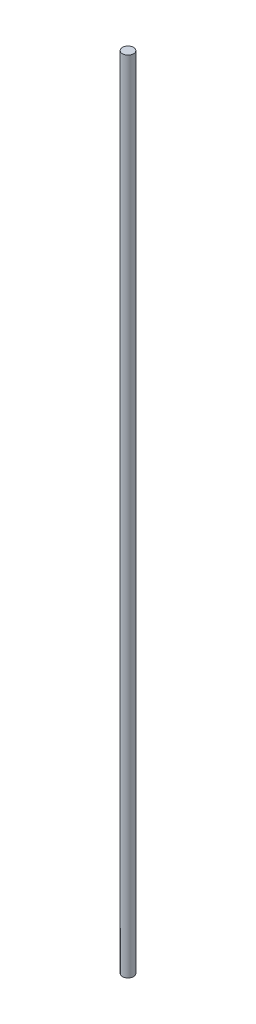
ISO-10303-21;
HEADER;
FILE_DESCRIPTION(('STEP AP214'),'2;1');
FILE_NAME('part.step','',(''),(''),'','','');
FILE_SCHEMA(('AUTOMOTIVE_DESIGN { 1 0 10303 214 1 1 1 1 }'));
ENDSEC;
DATA;
#1=APPLICATION_CONTEXT('core data for automotive mechanical design processes');
#2=APPLICATION_PROTOCOL_DEFINITION('international standard','automotive_design',2000,#1);
#3=PRODUCT_CONTEXT('',#1,'mechanical');
#4=PRODUCT('Part','Part','',(#3));
#5=PRODUCT_RELATED_PRODUCT_CATEGORY('part','',(#4));
#6=PRODUCT_DEFINITION_FORMATION('','',#4);
#7=PRODUCT_DEFINITION_CONTEXT('part definition',#1,'design');
#8=PRODUCT_DEFINITION('design','',#6,#7);
#9=PRODUCT_DEFINITION_SHAPE('','',#8);
#10=(LENGTH_UNIT() NAMED_UNIT(*) SI_UNIT(.MILLI.,.METRE.));
#11=(NAMED_UNIT(*) PLANE_ANGLE_UNIT() SI_UNIT($,.RADIAN.));
#12=(NAMED_UNIT(*) SI_UNIT($,.STERADIAN.) SOLID_ANGLE_UNIT());
#13=UNCERTAINTY_MEASURE_WITH_UNIT(LENGTH_MEASURE(1.E-05),#10,'distance_accuracy_value','');
#14=(GEOMETRIC_REPRESENTATION_CONTEXT(3) GLOBAL_UNCERTAINTY_ASSIGNED_CONTEXT((#13)) GLOBAL_UNIT_ASSIGNED_CONTEXT((#10,
#11,#12)) REPRESENTATION_CONTEXT('',''));
#15=CARTESIAN_POINT('',(0.,0.,0.));
#16=DIRECTION('',(0.,0.,1.));
#17=DIRECTION('',(1.,0.,0.));
#18=AXIS2_PLACEMENT_3D('',#15,#16,#17);
#19=CARTESIAN_POINT('',(0.,179.1,0.));
#20=DIRECTION('',(0.,-1.,0.));
#21=DIRECTION('',(1.,0.,0.));
#22=AXIS2_PLACEMENT_3D('',#19,#20,#21);
#23=CYLINDRICAL_SURFACE('',#22,2.4875);
#24=CARTESIAN_POINT('',(0.,179.1,0.));
#25=DIRECTION('',(0.,-1.,0.));
#26=DIRECTION('',(1.,0.,0.));
#27=AXIS2_PLACEMENT_3D('',#24,#25,#26);
#28=CIRCLE('',#27,2.4875);
#29=CARTESIAN_POINT('',(2.48749999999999,179.1,0.));
#30=VERTEX_POINT('',#29);
#31=EDGE_CURVE('E10',#30,#30,#28,.T.);
#32=ORIENTED_EDGE('',*,*,#31,.T.);
#33=EDGE_LOOP('',(#32));
#34=FACE_BOUND('',#33,.T.);
#35=CARTESIAN_POINT('',(0.,-179.1,0.));
#36=DIRECTION('',(0.,-1.,0.));
#37=DIRECTION('',(1.,0.,0.));
#38=AXIS2_PLACEMENT_3D('',#35,#36,#37);
#39=CIRCLE('',#38,2.4875);
#40=CARTESIAN_POINT('',(2.48749999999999,-179.1,0.));
#41=VERTEX_POINT('',#40);
#42=EDGE_CURVE('E21',#41,#41,#39,.T.);
#43=ORIENTED_EDGE('',*,*,#42,.F.);
#44=EDGE_LOOP('',(#43));
#45=FACE_BOUND('',#44,.T.);
#46=ADVANCED_FACE('F14',(#34,#45),#23,.T.);
#47=CARTESIAN_POINT('',(0.,179.1,0.));
#48=DIRECTION('',(0.,-1.,0.));
#49=DIRECTION('',(1.,0.,0.));
#50=AXIS2_PLACEMENT_3D('',#47,#48,#49);
#51=PLANE('',#50);
#52=ORIENTED_EDGE('',*,*,#31,.F.);
#53=EDGE_LOOP('',(#52));
#54=FACE_BOUND('',#53,.T.);
#55=ADVANCED_FACE('F49',(#54),#51,.F.);
#56=CARTESIAN_POINT('',(0.,-179.1,0.));
#57=DIRECTION('',(0.,-1.,0.));
#58=DIRECTION('',(1.,0.,0.));
#59=AXIS2_PLACEMENT_3D('',#56,#57,#58);
#60=PLANE('',#59);
#61=ORIENTED_EDGE('',*,*,#42,.T.);
#62=EDGE_LOOP('',(#61));
#63=FACE_BOUND('',#62,.T.);
#64=ADVANCED_FACE('F46',(#63),#60,.T.);
#65=CLOSED_SHELL('',(#46,#55,#64));
#66=MANIFOLD_SOLID_BREP('B1',#65);
#67=ADVANCED_BREP_SHAPE_REPRESENTATION('',(#18,#66),#14);
#68=SHAPE_DEFINITION_REPRESENTATION(#9,#67);
ENDSEC;
END-ISO-10303-21;
